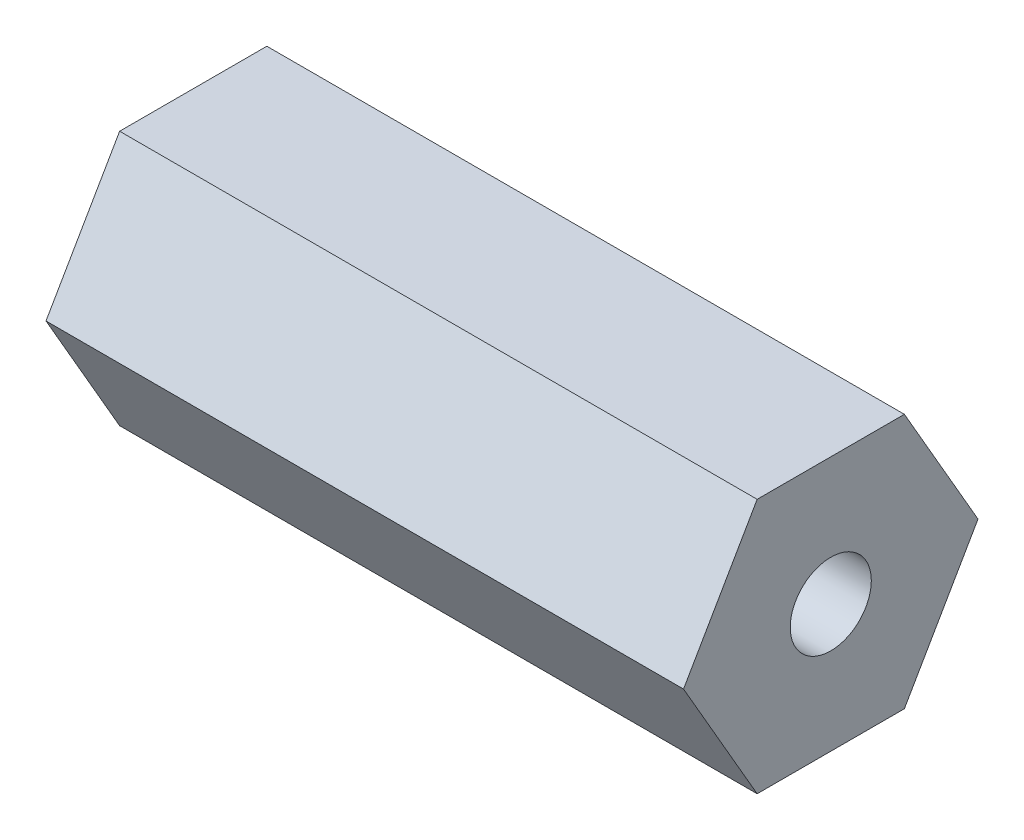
ISO-10303-21;
HEADER;
FILE_DESCRIPTION(('STEP AP214'),'2;1');
FILE_NAME('part.step','',(''),(''),'','','');
FILE_SCHEMA(('AUTOMOTIVE_DESIGN { 1 0 10303 214 1 1 1 1 }'));
ENDSEC;
DATA;
#1=APPLICATION_CONTEXT('core data for automotive mechanical design processes');
#2=APPLICATION_PROTOCOL_DEFINITION('international standard','automotive_design',2000,#1);
#3=PRODUCT_CONTEXT('',#1,'mechanical');
#4=PRODUCT('Part','Part','',(#3));
#5=PRODUCT_RELATED_PRODUCT_CATEGORY('part','',(#4));
#6=PRODUCT_DEFINITION_FORMATION('','',#4);
#7=PRODUCT_DEFINITION_CONTEXT('part definition',#1,'design');
#8=PRODUCT_DEFINITION('design','',#6,#7);
#9=PRODUCT_DEFINITION_SHAPE('','',#8);
#10=(LENGTH_UNIT() NAMED_UNIT(*) SI_UNIT(.MILLI.,.METRE.));
#11=(NAMED_UNIT(*) PLANE_ANGLE_UNIT() SI_UNIT($,.RADIAN.));
#12=(NAMED_UNIT(*) SI_UNIT($,.STERADIAN.) SOLID_ANGLE_UNIT());
#13=UNCERTAINTY_MEASURE_WITH_UNIT(LENGTH_MEASURE(1.E-05),#10,'distance_accuracy_value','');
#14=(GEOMETRIC_REPRESENTATION_CONTEXT(3) GLOBAL_UNCERTAINTY_ASSIGNED_CONTEXT((#13)) GLOBAL_UNIT_ASSIGNED_CONTEXT((#10,
#11,#12)) REPRESENTATION_CONTEXT('',''));
#15=CARTESIAN_POINT('',(0.,0.,0.));
#16=DIRECTION('',(0.,0.,1.));
#17=DIRECTION('',(1.,0.,0.));
#18=AXIS2_PLACEMENT_3D('',#15,#16,#17);
#19=CARTESIAN_POINT('',(31.75,-6.34999999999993,-3.66617420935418));
#20=DIRECTION('',(0.,0.499999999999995,0.866025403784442));
#21=DIRECTION('',(0.,-0.866025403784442,0.499999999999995));
#22=AXIS2_PLACEMENT_3D('',#19,#20,#21);
#23=PLANE('',#22);
#24=DIRECTION('',(0.,0.866025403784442,-0.499999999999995));
#25=VECTOR('',#24,1.);
#26=CARTESIAN_POINT('',(0.,-6.34999999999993,-3.66617420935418));
#27=LINE('',#26,#25);
#28=CARTESIAN_POINT('',(0.,-6.34999999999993,-3.66617420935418));
#29=VERTEX_POINT('',#28);
#30=CARTESIAN_POINT('',(0.,0.,-7.33234841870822));
#31=VERTEX_POINT('',#30);
#32=EDGE_CURVE('E121',#29,#31,#27,.T.);
#33=ORIENTED_EDGE('',*,*,#32,.T.);
#34=DIRECTION('',(-1.,0.,0.));
#35=VECTOR('',#34,1.);
#36=CARTESIAN_POINT('',(31.75,0.,-7.33234841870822));
#37=LINE('',#36,#35);
#38=CARTESIAN_POINT('',(31.75,0.,-7.33234841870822));
#39=VERTEX_POINT('',#38);
#40=EDGE_CURVE('E11',#39,#31,#37,.T.);
#41=ORIENTED_EDGE('',*,*,#40,.F.);
#42=DIRECTION('',(0.,0.866025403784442,-0.499999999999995));
#43=VECTOR('',#42,1.);
#44=CARTESIAN_POINT('',(31.75,-6.34999999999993,-3.66617420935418));
#45=LINE('',#44,#43);
#46=CARTESIAN_POINT('',(31.75,-6.34999999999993,-3.66617420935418));
#47=VERTEX_POINT('',#46);
#48=EDGE_CURVE('E132',#47,#39,#45,.T.);
#49=ORIENTED_EDGE('',*,*,#48,.F.);
#50=DIRECTION('',(-1.,0.,0.));
#51=VECTOR('',#50,1.);
#52=CARTESIAN_POINT('',(31.75,-6.34999999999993,-3.66617420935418));
#53=LINE('',#52,#51);
#54=EDGE_CURVE('E117',#47,#29,#53,.T.);
#55=ORIENTED_EDGE('',*,*,#54,.T.);
#56=EDGE_LOOP('',(#33,#41,#49,#55));
#57=FACE_BOUND('',#56,.T.);
#58=ADVANCED_FACE('F37',(#57),#23,.F.);
#59=CARTESIAN_POINT('',(31.75,0.,-7.33234841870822));
#60=DIRECTION('',(0.,-0.500000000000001,0.866025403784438));
#61=DIRECTION('',(0.,-0.866025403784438,-0.500000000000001));
#62=AXIS2_PLACEMENT_3D('',#59,#60,#61);
#63=PLANE('',#62);
#64=DIRECTION('',(0.,0.866025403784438,0.500000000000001));
#65=VECTOR('',#64,1.);
#66=CARTESIAN_POINT('',(0.,0.,-7.33234841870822));
#67=LINE('',#66,#65);
#68=CARTESIAN_POINT('',(0.,6.34999999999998,-3.6661742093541));
#69=VERTEX_POINT('',#68);
#70=EDGE_CURVE('E124',#31,#69,#67,.T.);
#71=ORIENTED_EDGE('',*,*,#70,.T.);
#72=DIRECTION('',(-1.,0.,0.));
#73=VECTOR('',#72,1.);
#74=CARTESIAN_POINT('',(31.75,6.34999999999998,-3.6661742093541));
#75=LINE('',#74,#73);
#76=CARTESIAN_POINT('',(31.75,6.34999999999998,-3.6661742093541));
#77=VERTEX_POINT('',#76);
#78=EDGE_CURVE('E45',#77,#69,#75,.T.);
#79=ORIENTED_EDGE('',*,*,#78,.F.);
#80=DIRECTION('',(0.,0.866025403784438,0.500000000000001));
#81=VECTOR('',#80,1.);
#82=CARTESIAN_POINT('',(31.75,0.,-7.33234841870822));
#83=LINE('',#82,#81);
#84=EDGE_CURVE('E90',#39,#77,#83,.T.);
#85=ORIENTED_EDGE('',*,*,#84,.F.);
#86=ORIENTED_EDGE('',*,*,#40,.T.);
#87=EDGE_LOOP('',(#71,#79,#85,#86));
#88=FACE_BOUND('',#87,.T.);
#89=ADVANCED_FACE('F157',(#88),#63,.F.);
#90=CARTESIAN_POINT('',(31.75,6.34999999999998,-3.6661742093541));
#91=DIRECTION('',(0.,-1.,0.));
#92=DIRECTION('',(0.,0.,-1.));
#93=AXIS2_PLACEMENT_3D('',#90,#91,#92);
#94=PLANE('',#93);
#95=DIRECTION('',(0.,0.,1.));
#96=VECTOR('',#95,1.);
#97=CARTESIAN_POINT('',(0.,6.34999999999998,-3.6661742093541));
#98=LINE('',#97,#96);
#99=CARTESIAN_POINT('',(0.,6.34999999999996,3.66617420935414));
#100=VERTEX_POINT('',#99);
#101=EDGE_CURVE('E127',#69,#100,#98,.T.);
#102=ORIENTED_EDGE('',*,*,#101,.T.);
#103=DIRECTION('',(-1.,0.,0.));
#104=VECTOR('',#103,1.);
#105=CARTESIAN_POINT('',(31.75,6.34999999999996,3.66617420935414));
#106=LINE('',#105,#104);
#107=CARTESIAN_POINT('',(31.75,6.34999999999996,3.66617420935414));
#108=VERTEX_POINT('',#107);
#109=EDGE_CURVE('E112',#108,#100,#106,.T.);
#110=ORIENTED_EDGE('',*,*,#109,.F.);
#111=DIRECTION('',(0.,0.,1.));
#112=VECTOR('',#111,1.);
#113=CARTESIAN_POINT('',(31.75,6.34999999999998,-3.6661742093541));
#114=LINE('',#113,#112);
#115=EDGE_CURVE('E103',#77,#108,#114,.T.);
#116=ORIENTED_EDGE('',*,*,#115,.F.);
#117=ORIENTED_EDGE('',*,*,#78,.T.);
#118=EDGE_LOOP('',(#102,#110,#116,#117));
#119=FACE_BOUND('',#118,.T.);
#120=ADVANCED_FACE('F138',(#119),#94,.F.);
#121=CARTESIAN_POINT('',(31.75,6.34999999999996,3.66617420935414));
#122=DIRECTION('',(0.,-0.499999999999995,-0.866025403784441));
#123=DIRECTION('',(0.,0.866025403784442,-0.499999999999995));
#124=AXIS2_PLACEMENT_3D('',#121,#122,#123);
#125=PLANE('',#124);
#126=DIRECTION('',(0.,-0.866025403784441,0.499999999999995));
#127=VECTOR('',#126,1.);
#128=CARTESIAN_POINT('',(0.,6.34999999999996,3.66617420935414));
#129=LINE('',#128,#127);
#130=CARTESIAN_POINT('',(0.,0.,7.33234841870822));
#131=VERTEX_POINT('',#130);
#132=EDGE_CURVE('E111',#100,#131,#129,.T.);
#133=ORIENTED_EDGE('',*,*,#132,.T.);
#134=DIRECTION('',(-1.,0.,0.));
#135=VECTOR('',#134,1.);
#136=CARTESIAN_POINT('',(31.75,0.,7.33234841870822));
#137=LINE('',#136,#135);
#138=CARTESIAN_POINT('',(31.75,0.,7.33234841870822));
#139=VERTEX_POINT('',#138);
#140=EDGE_CURVE('E108',#139,#131,#137,.T.);
#141=ORIENTED_EDGE('',*,*,#140,.F.);
#142=DIRECTION('',(0.,-0.866025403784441,0.499999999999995));
#143=VECTOR('',#142,1.);
#144=CARTESIAN_POINT('',(31.75,6.34999999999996,3.66617420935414));
#145=LINE('',#144,#143);
#146=EDGE_CURVE('E97',#108,#139,#145,.T.);
#147=ORIENTED_EDGE('',*,*,#146,.F.);
#148=ORIENTED_EDGE('',*,*,#109,.T.);
#149=EDGE_LOOP('',(#133,#141,#147,#148));
#150=FACE_BOUND('',#149,.T.);
#151=ADVANCED_FACE('F109',(#150),#125,.F.);
#152=CARTESIAN_POINT('',(31.75,0.,7.33234841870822));
#153=DIRECTION('',(0.,0.500000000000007,-0.866025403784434));
#154=DIRECTION('',(0.,0.866025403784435,0.500000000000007));
#155=AXIS2_PLACEMENT_3D('',#152,#153,#154);
#156=PLANE('',#155);
#157=DIRECTION('',(0.,-0.866025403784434,-0.500000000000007));
#158=VECTOR('',#157,1.);
#159=CARTESIAN_POINT('',(0.,0.,7.33234841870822));
#160=LINE('',#159,#158);
#161=CARTESIAN_POINT('',(0.,-6.35000000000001,3.66617420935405));
#162=VERTEX_POINT('',#161);
#163=EDGE_CURVE('E76',#131,#162,#160,.T.);
#164=ORIENTED_EDGE('',*,*,#163,.T.);
#165=DIRECTION('',(-1.,0.,0.));
#166=VECTOR('',#165,1.);
#167=CARTESIAN_POINT('',(31.75,-6.35000000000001,3.66617420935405));
#168=LINE('',#167,#166);
#169=CARTESIAN_POINT('',(31.75,-6.35000000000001,3.66617420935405));
#170=VERTEX_POINT('',#169);
#171=EDGE_CURVE('E113',#170,#162,#168,.T.);
#172=ORIENTED_EDGE('',*,*,#171,.F.);
#173=DIRECTION('',(0.,-0.866025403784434,-0.500000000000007));
#174=VECTOR('',#173,1.);
#175=CARTESIAN_POINT('',(31.75,0.,7.33234841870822));
#176=LINE('',#175,#174);
#177=EDGE_CURVE('E101',#139,#170,#176,.T.);
#178=ORIENTED_EDGE('',*,*,#177,.F.);
#179=ORIENTED_EDGE('',*,*,#140,.T.);
#180=EDGE_LOOP('',(#164,#172,#178,#179));
#181=FACE_BOUND('',#180,.T.);
#182=ADVANCED_FACE('F115',(#181),#156,.F.);
#183=CARTESIAN_POINT('',(31.75,-6.35000000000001,3.66617420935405));
#184=DIRECTION('',(0.,1.,0.));
#185=DIRECTION('',(0.,0.,1.));
#186=AXIS2_PLACEMENT_3D('',#183,#184,#185);
#187=PLANE('',#186);
#188=DIRECTION('',(0.,0.,-1.));
#189=VECTOR('',#188,1.);
#190=CARTESIAN_POINT('',(0.,-6.35000000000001,3.66617420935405));
#191=LINE('',#190,#189);
#192=EDGE_CURVE('E82',#162,#29,#191,.T.);
#193=ORIENTED_EDGE('',*,*,#192,.T.);
#194=ORIENTED_EDGE('',*,*,#54,.F.);
#195=DIRECTION('',(0.,0.,-1.));
#196=VECTOR('',#195,1.);
#197=CARTESIAN_POINT('',(31.75,-6.35000000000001,3.66617420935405));
#198=LINE('',#197,#196);
#199=EDGE_CURVE('E53',#170,#47,#198,.T.);
#200=ORIENTED_EDGE('',*,*,#199,.F.);
#201=ORIENTED_EDGE('',*,*,#171,.T.);
#202=EDGE_LOOP('',(#193,#194,#200,#201));
#203=FACE_BOUND('',#202,.T.);
#204=ADVANCED_FACE('F145',(#203),#187,.F.);
#205=CARTESIAN_POINT('',(31.75,0.,0.));
#206=DIRECTION('',(1.,0.,0.));
#207=DIRECTION('',(0.,0.,-1.));
#208=AXIS2_PLACEMENT_3D('',#205,#206,#207);
#209=PLANE('',#208);
#210=CARTESIAN_POINT('',(31.75,0.,0.));
#211=DIRECTION('',(1.,0.,0.));
#212=DIRECTION('',(0.,0.,-1.));
#213=AXIS2_PLACEMENT_3D('',#210,#211,#212);
#214=CIRCLE('',#213,2.01929999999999);
#215=CARTESIAN_POINT('',(31.75,0.,-2.01930000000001));
#216=VERTEX_POINT('',#215);
#217=EDGE_CURVE('E214',#216,#216,#214,.T.);
#218=ORIENTED_EDGE('',*,*,#217,.F.);
#219=EDGE_LOOP('',(#218));
#220=FACE_BOUND('',#219,.T.);
#221=ORIENTED_EDGE('',*,*,#48,.T.);
#222=ORIENTED_EDGE('',*,*,#84,.T.);
#223=ORIENTED_EDGE('',*,*,#115,.T.);
#224=ORIENTED_EDGE('',*,*,#146,.T.);
#225=ORIENTED_EDGE('',*,*,#177,.T.);
#226=ORIENTED_EDGE('',*,*,#199,.T.);
#227=EDGE_LOOP('',(#221,#222,#223,#224,#225,#226));
#228=FACE_BOUND('',#227,.T.);
#229=ADVANCED_FACE('F99',(#220,#228),#209,.T.);
#230=CARTESIAN_POINT('',(0.,0.,0.));
#231=DIRECTION('',(1.,0.,0.));
#232=DIRECTION('',(0.,0.,-1.));
#233=AXIS2_PLACEMENT_3D('',#230,#231,#232);
#234=PLANE('',#233);
#235=CARTESIAN_POINT('',(0.,0.,0.));
#236=DIRECTION('',(1.,0.,0.));
#237=DIRECTION('',(0.,0.,-1.));
#238=AXIS2_PLACEMENT_3D('',#235,#236,#237);
#239=CIRCLE('',#238,2.01929999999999);
#240=CARTESIAN_POINT('',(0.,0.,-2.01930000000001));
#241=VERTEX_POINT('',#240);
#242=EDGE_CURVE('E125',#241,#241,#239,.T.);
#243=ORIENTED_EDGE('',*,*,#242,.T.);
#244=EDGE_LOOP('',(#243));
#245=FACE_BOUND('',#244,.T.);
#246=ORIENTED_EDGE('',*,*,#32,.F.);
#247=ORIENTED_EDGE('',*,*,#192,.F.);
#248=ORIENTED_EDGE('',*,*,#163,.F.);
#249=ORIENTED_EDGE('',*,*,#132,.F.);
#250=ORIENTED_EDGE('',*,*,#101,.F.);
#251=ORIENTED_EDGE('',*,*,#70,.F.);
#252=EDGE_LOOP('',(#246,#247,#248,#249,#250,#251));
#253=FACE_BOUND('',#252,.T.);
#254=ADVANCED_FACE('F141',(#245,#253),#234,.F.);
#255=CARTESIAN_POINT('',(31.75,0.,0.));
#256=DIRECTION('',(1.,0.,0.));
#257=DIRECTION('',(0.,0.,-1.));
#258=AXIS2_PLACEMENT_3D('',#255,#256,#257);
#259=CYLINDRICAL_SURFACE('',#258,2.01929999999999);
#260=ORIENTED_EDGE('',*,*,#242,.F.);
#261=EDGE_LOOP('',(#260));
#262=FACE_BOUND('',#261,.T.);
#263=ORIENTED_EDGE('',*,*,#217,.T.);
#264=EDGE_LOOP('',(#263));
#265=FACE_BOUND('',#264,.T.);
#266=ADVANCED_FACE('F194',(#262,#265),#259,.F.);
#267=CLOSED_SHELL('',(#58,#89,#120,#151,#182,#204,#229,#254,#266));
#268=MANIFOLD_SOLID_BREP('B2',#267);
#269=ADVANCED_BREP_SHAPE_REPRESENTATION('',(#18,#268),#14);
#270=SHAPE_DEFINITION_REPRESENTATION(#9,#269);
ENDSEC;
END-ISO-10303-21;
